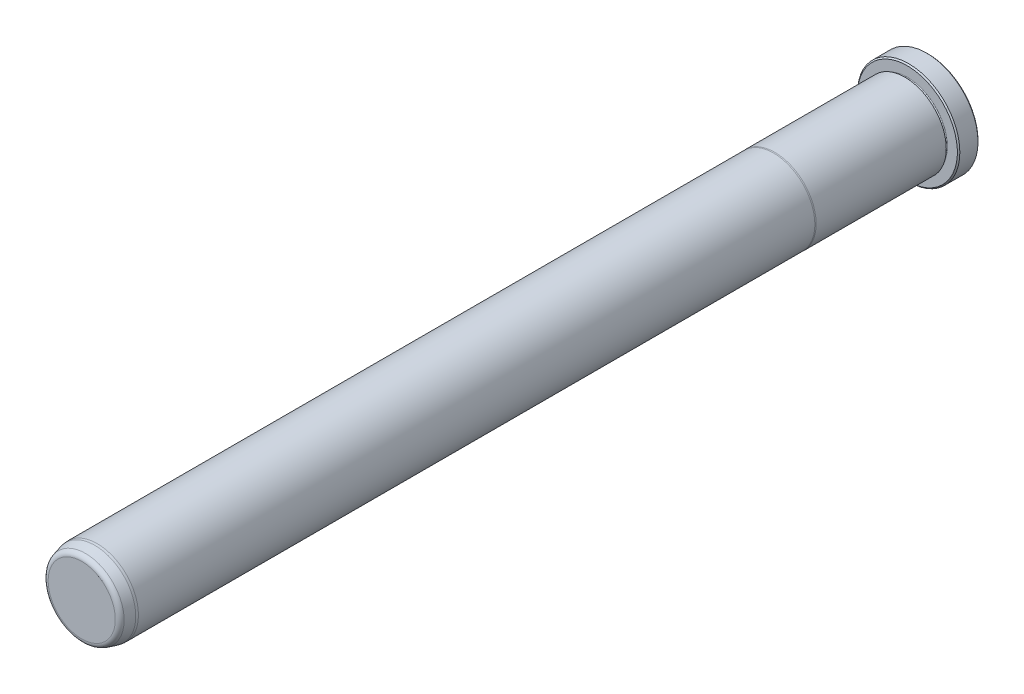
from build123d import *

# Parameters (mm, degrees)
FILLET6_R     = 1.5875
CHAMFER1_SIZE = 0.381


with BuildPart() as part:
    # Sketch1 → Revolve1 (revolve)
    with BuildSketch(Plane(origin=(0, 0, 0), x_dir=(0, 0, -1), z_dir=(1, 0, 0)), mode=Mode.PRIVATE) as revolve1_sk:
        with BuildLine():
            Line((0, 0), (0, 15.748))
            Line((0, 15.748), (-6.35, 15.748))
            Line((-6.35, 15.748), (-6.35, 12.3063))
            ThreePointArc((-6.35, 12.3063), (-6.731, 11.9253), (-7.112, 12.3063))
            Line((-7.112, 12.3063), (-7.112, 12.7127))
            Line((-7.112, 12.7127), (-47.134763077, 12.7127))
            Line((-47.134763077, 12.7127), (-47.498, 12.6873))
            Line((-47.498, 12.6873), (-255.5875, 12.6873))
            Line((-255.5875, 12.6873), (-256.3495, 12.620633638))
            Line((-256.3495, 12.620633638), (-260.35, 11.548702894))
            Line((-260.35, 11.548702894), (-260.35, 0))
            Line((-260.35, 0), (0, 0))
        make_face()
    revolve(revolve1_sk.sketch.rotate(Axis((0, 0, 0), (0, 0, -1)), 90), axis=Axis((0, 0, 0), (0, 0, -1)))

    # Fillet6
    fillet6_edges = [part.edges().sort_by_distance(p)[0] for p in [
        (-11.548702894, 0, 260.35),
    ]]
    fillet(fillet6_edges, radius=FILLET6_R)

    # Chamfer1
    chamfer1_edges = [part.edges().sort_by_distance(p)[0] for p in [
        (-15.748, 0, 6.35),
        (-15.748, 0, 0),
    ]]
    chamfer(chamfer1_edges, length=CHAMFER1_SIZE)


solid = part.part
